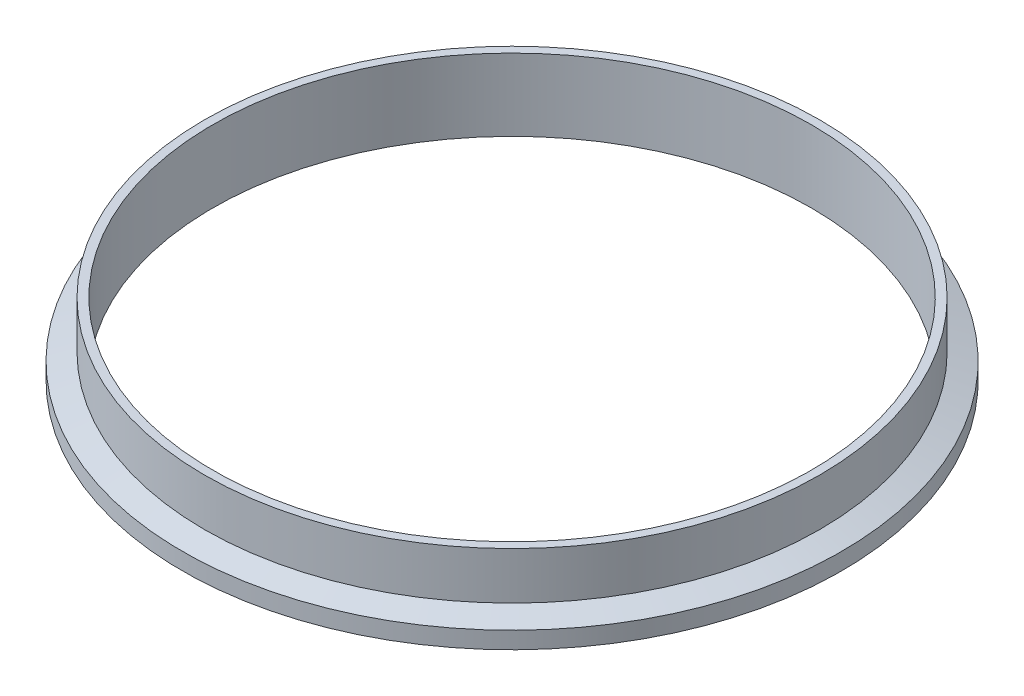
from build123d import *


with BuildPart() as part:
    # Sketch1 → Revolve2 (revolve)
    with BuildSketch(Plane.XY, mode=Mode.PRIVATE) as revolve2_sk:
        with BuildLine():
            Line((-98.8314, 0), (-98.8314, 23.8252))
            Line((-98.8314, 23.8252), (-101.6, 23.8252))
            Line((-101.6, 23.8252), (-101.6, 8.222780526))
            Line((-101.6, 8.222780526), (-108.839, 5.588))
            Line((-108.839, 5.588), (-108.839, 0))
            Line((-108.839, 0), (-105.399208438, 0))
            ThreePointArc((-105.399208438, 0), (-104.967011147, 0.129217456), (-104.676666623, 0.474458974))
            ThreePointArc((-104.676666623, 0.474458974), (-103.5812, 1.1938), (-102.485733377, 0.474458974))
            ThreePointArc((-102.485733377, 0.474458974), (-102.195388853, 0.129217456), (-101.763191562, 0))
            Line((-101.763191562, 0), (-98.8314, 0))
        make_face()
    revolve(revolve2_sk.sketch.rotate(Axis((0, 0, 0), (0, 1, 0)), 270), axis=Axis((0, 0, 0), (0, 1, 0)))


solid = part.part
